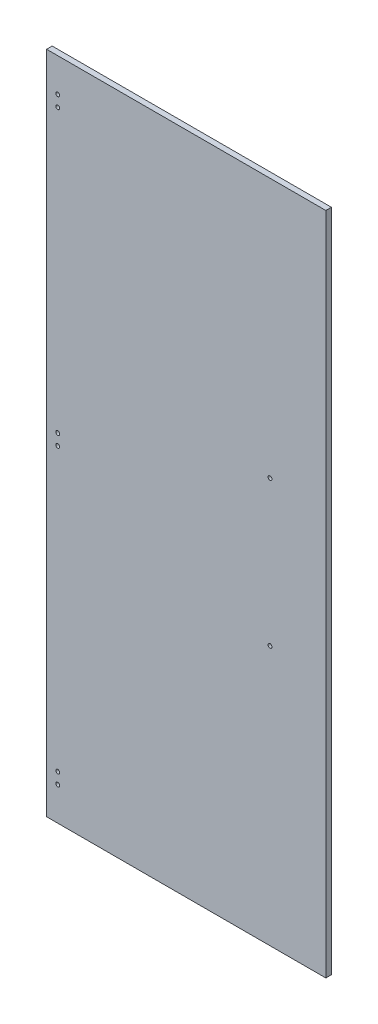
from build123d import *

# Parameters (mm, degrees)
SKETCH1_W           = 250
SKETCH1_H           = 595
BOSS_EXTRUDE1_DEPTH = 5
SKETCH2_R           = 1.75
CUT_EXTRUDE1_DEPTH  = 30


with BuildPart() as part:
    # Sketch1 → Boss-Extrude1 (new body)
    with BuildSketch(Plane.XY):
        Rectangle(SKETCH1_W, SKETCH1_H)
    extrude(amount=BOSS_EXTRUDE1_DEPTH)

    # Sketch2 → Cut-Extrude1 (cut)
    with BuildSketch(Plane.XY.offset(5)):
        with Locations((75, 65)):
            Circle(SKETCH2_R)
        with Locations((75, -65)):
            Circle(SKETCH2_R)
        with Locations((-115, -267.5)):
            Circle(SKETCH2_R)
        with Locations((-115, -257.5)):
            Circle(SKETCH2_R)
        with Locations(Location((-115, -5, 0), (0, 0, 180))):
            Circle(SKETCH2_R)
        with Locations(Location((-115, 5, 0), (0, 0, 180))):
            Circle(SKETCH2_R)
        with Locations(Location((-115, 267.5, 0), (0, 0, 180))):
            Circle(SKETCH2_R)
        with Locations(Location((-115, 257.5, 0), (0, 0, 180))):
            Circle(SKETCH2_R)
    extrude(amount=-CUT_EXTRUDE1_DEPTH, mode=Mode.SUBTRACT)


solid = part.part
